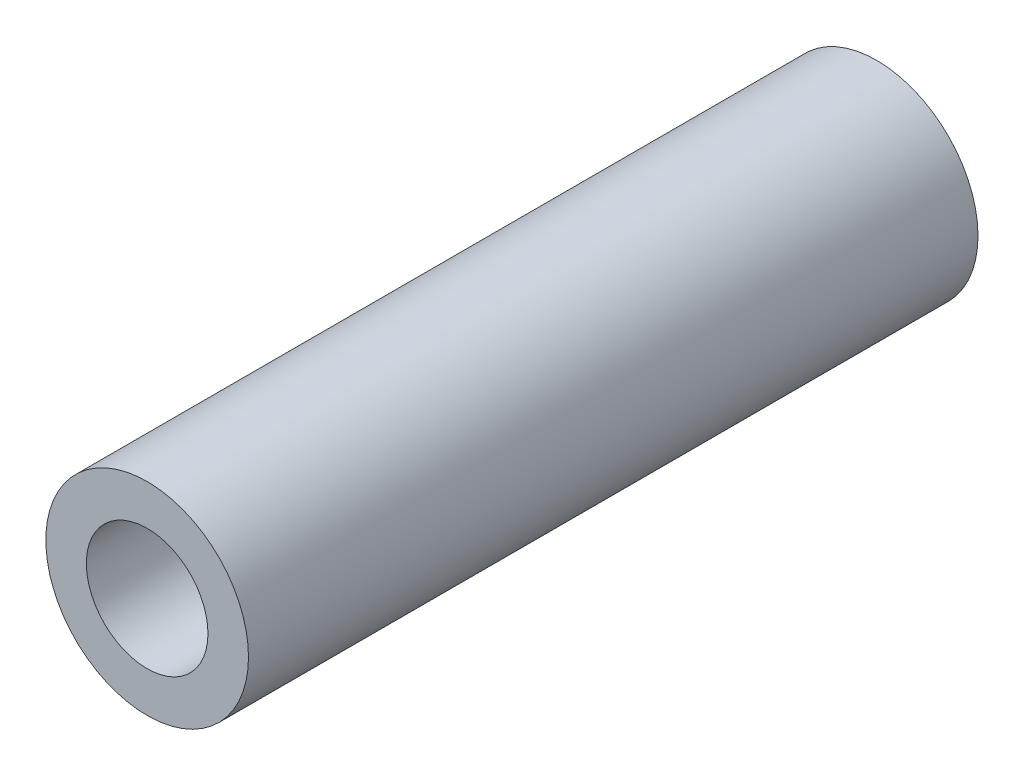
from build123d import *

# Parameters (mm, degrees)
ESQUISSE1_R      = 15
ESQUISSE1_R_2    = 9
EXTRUSION1_DEPTH = 108


with BuildPart() as part:
    # Esquisse1 → Extrusion1 (new body)
    with BuildSketch(Plane.XY):
        Circle(ESQUISSE1_R)
        Circle(ESQUISSE1_R_2, mode=Mode.SUBTRACT)
    extrude(amount=EXTRUSION1_DEPTH)


solid = part.part
